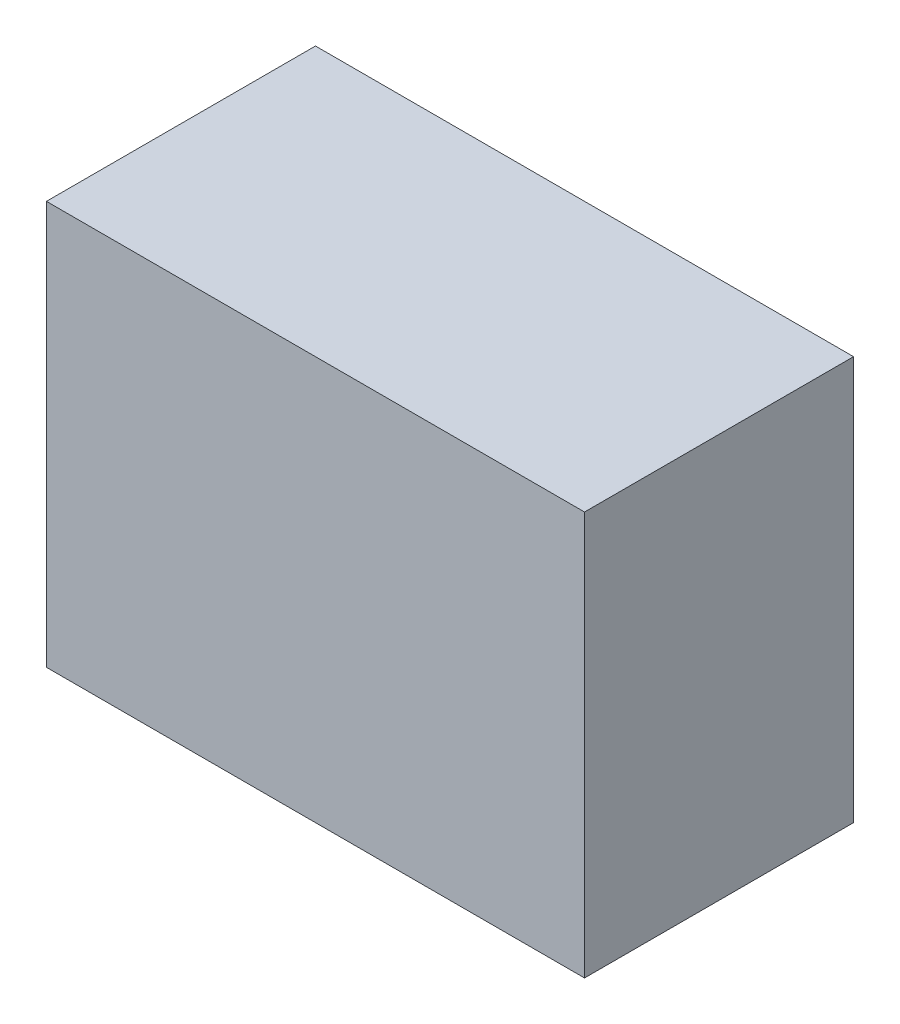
ISO-10303-21;
HEADER;
FILE_DESCRIPTION(('STEP AP214'),'2;1');
FILE_NAME('part.step','',(''),(''),'','','');
FILE_SCHEMA(('AUTOMOTIVE_DESIGN { 1 0 10303 214 1 1 1 1 }'));
ENDSEC;
DATA;
#1=APPLICATION_CONTEXT('core data for automotive mechanical design processes');
#2=APPLICATION_PROTOCOL_DEFINITION('international standard','automotive_design',2000,#1);
#3=PRODUCT_CONTEXT('',#1,'mechanical');
#4=PRODUCT('Part','Part','',(#3));
#5=PRODUCT_RELATED_PRODUCT_CATEGORY('part','',(#4));
#6=PRODUCT_DEFINITION_FORMATION('','',#4);
#7=PRODUCT_DEFINITION_CONTEXT('part definition',#1,'design');
#8=PRODUCT_DEFINITION('design','',#6,#7);
#9=PRODUCT_DEFINITION_SHAPE('','',#8);
#10=(LENGTH_UNIT() NAMED_UNIT(*) SI_UNIT(.MILLI.,.METRE.));
#11=(NAMED_UNIT(*) PLANE_ANGLE_UNIT() SI_UNIT($,.RADIAN.));
#12=(NAMED_UNIT(*) SI_UNIT($,.STERADIAN.) SOLID_ANGLE_UNIT());
#13=UNCERTAINTY_MEASURE_WITH_UNIT(LENGTH_MEASURE(1.E-05),#10,'distance_accuracy_value','');
#14=(GEOMETRIC_REPRESENTATION_CONTEXT(3) GLOBAL_UNCERTAINTY_ASSIGNED_CONTEXT((#13)) GLOBAL_UNIT_ASSIGNED_CONTEXT((#10,
#11,#12)) REPRESENTATION_CONTEXT('',''));
#15=CARTESIAN_POINT('',(0.,0.,0.));
#16=DIRECTION('',(0.,0.,1.));
#17=DIRECTION('',(1.,0.,0.));
#18=AXIS2_PLACEMENT_3D('',#15,#16,#17);
#19=CARTESIAN_POINT('',(1.00000000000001,1.5,0.5));
#20=DIRECTION('',(-1.,0.,0.));
#21=DIRECTION('',(0.,0.,1.));
#22=AXIS2_PLACEMENT_3D('',#19,#20,#21);
#23=PLANE('',#22);
#24=DIRECTION('',(0.,0.,-1.));
#25=VECTOR('',#24,1.);
#26=CARTESIAN_POINT('',(1.00000000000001,0.,0.5));
#27=LINE('',#26,#25);
#28=CARTESIAN_POINT('',(1.00000000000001,0.,0.5));
#29=VERTEX_POINT('',#28);
#30=CARTESIAN_POINT('',(1.00000000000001,0.,-0.5));
#31=VERTEX_POINT('',#30);
#32=EDGE_CURVE('E95',#29,#31,#27,.T.);
#33=ORIENTED_EDGE('',*,*,#32,.T.);
#34=DIRECTION('',(0.,-1.,0.));
#35=VECTOR('',#34,1.);
#36=CARTESIAN_POINT('',(1.00000000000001,1.5,-0.5));
#37=LINE('',#36,#35);
#38=CARTESIAN_POINT('',(1.00000000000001,1.5,-0.5));
#39=VERTEX_POINT('',#38);
#40=EDGE_CURVE('E11',#39,#31,#37,.T.);
#41=ORIENTED_EDGE('',*,*,#40,.F.);
#42=DIRECTION('',(0.,0.,-1.));
#43=VECTOR('',#42,1.);
#44=CARTESIAN_POINT('',(1.00000000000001,1.5,0.5));
#45=LINE('',#44,#43);
#46=CARTESIAN_POINT('',(1.00000000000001,1.5,0.5));
#47=VERTEX_POINT('',#46);
#48=EDGE_CURVE('E83',#47,#39,#45,.T.);
#49=ORIENTED_EDGE('',*,*,#48,.F.);
#50=DIRECTION('',(0.,-1.,0.));
#51=VECTOR('',#50,1.);
#52=CARTESIAN_POINT('',(1.00000000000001,1.5,0.5));
#53=LINE('',#52,#51);
#54=EDGE_CURVE('E91',#47,#29,#53,.T.);
#55=ORIENTED_EDGE('',*,*,#54,.T.);
#56=EDGE_LOOP('',(#33,#41,#49,#55));
#57=FACE_BOUND('',#56,.T.);
#58=ADVANCED_FACE('F32',(#57),#23,.F.);
#59=CARTESIAN_POINT('',(-0.999999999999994,1.5,-0.5));
#60=DIRECTION('',(0.,0.,1.));
#61=DIRECTION('',(1.,0.,0.));
#62=AXIS2_PLACEMENT_3D('',#59,#60,#61);
#63=PLANE('',#62);
#64=DIRECTION('',(-1.,0.,0.));
#65=VECTOR('',#64,1.);
#66=CARTESIAN_POINT('',(-0.999999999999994,0.,-0.5));
#67=LINE('',#66,#65);
#68=CARTESIAN_POINT('',(-0.999999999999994,0.,-0.5));
#69=VERTEX_POINT('',#68);
#70=EDGE_CURVE('E87',#31,#69,#67,.T.);
#71=ORIENTED_EDGE('',*,*,#70,.T.);
#72=DIRECTION('',(0.,-1.,0.));
#73=VECTOR('',#72,1.);
#74=CARTESIAN_POINT('',(-0.999999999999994,1.5,-0.5));
#75=LINE('',#74,#73);
#76=CARTESIAN_POINT('',(-0.999999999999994,1.5,-0.5));
#77=VERTEX_POINT('',#76);
#78=EDGE_CURVE('E40',#77,#69,#75,.T.);
#79=ORIENTED_EDGE('',*,*,#78,.F.);
#80=DIRECTION('',(-1.,0.,0.));
#81=VECTOR('',#80,1.);
#82=CARTESIAN_POINT('',(-0.999999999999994,1.5,-0.5));
#83=LINE('',#82,#81);
#84=EDGE_CURVE('E78',#39,#77,#83,.T.);
#85=ORIENTED_EDGE('',*,*,#84,.F.);
#86=ORIENTED_EDGE('',*,*,#40,.T.);
#87=EDGE_LOOP('',(#71,#79,#85,#86));
#88=FACE_BOUND('',#87,.T.);
#89=ADVANCED_FACE('F86',(#88),#63,.F.);
#90=CARTESIAN_POINT('',(-0.999999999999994,1.5,0.5));
#91=DIRECTION('',(1.,0.,0.));
#92=DIRECTION('',(0.,0.,-1.));
#93=AXIS2_PLACEMENT_3D('',#90,#91,#92);
#94=PLANE('',#93);
#95=DIRECTION('',(0.,0.,1.));
#96=VECTOR('',#95,1.);
#97=CARTESIAN_POINT('',(-0.999999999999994,0.,0.5));
#98=LINE('',#97,#96);
#99=CARTESIAN_POINT('',(-0.999999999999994,0.,0.5));
#100=VERTEX_POINT('',#99);
#101=EDGE_CURVE('E65',#69,#100,#98,.T.);
#102=ORIENTED_EDGE('',*,*,#101,.T.);
#103=DIRECTION('',(0.,-1.,0.));
#104=VECTOR('',#103,1.);
#105=CARTESIAN_POINT('',(-0.999999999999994,1.5,0.5));
#106=LINE('',#105,#104);
#107=CARTESIAN_POINT('',(-0.999999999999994,1.5,0.5));
#108=VERTEX_POINT('',#107);
#109=EDGE_CURVE('E88',#108,#100,#106,.T.);
#110=ORIENTED_EDGE('',*,*,#109,.F.);
#111=DIRECTION('',(0.,0.,1.));
#112=VECTOR('',#111,1.);
#113=CARTESIAN_POINT('',(-0.999999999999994,1.5,0.5));
#114=LINE('',#113,#112);
#115=EDGE_CURVE('E81',#77,#108,#114,.T.);
#116=ORIENTED_EDGE('',*,*,#115,.F.);
#117=ORIENTED_EDGE('',*,*,#78,.T.);
#118=EDGE_LOOP('',(#102,#110,#116,#117));
#119=FACE_BOUND('',#118,.T.);
#120=ADVANCED_FACE('F89',(#119),#94,.F.);
#121=CARTESIAN_POINT('',(-0.999999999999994,1.5,0.5));
#122=DIRECTION('',(0.,0.,-1.));
#123=DIRECTION('',(-1.,0.,0.));
#124=AXIS2_PLACEMENT_3D('',#121,#122,#123);
#125=PLANE('',#124);
#126=DIRECTION('',(1.,0.,0.));
#127=VECTOR('',#126,1.);
#128=CARTESIAN_POINT('',(-0.999999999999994,0.,0.5));
#129=LINE('',#128,#127);
#130=EDGE_CURVE('E71',#100,#29,#129,.T.);
#131=ORIENTED_EDGE('',*,*,#130,.T.);
#132=ORIENTED_EDGE('',*,*,#54,.F.);
#133=DIRECTION('',(1.,0.,0.));
#134=VECTOR('',#133,1.);
#135=CARTESIAN_POINT('',(-0.999999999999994,1.5,0.5));
#136=LINE('',#135,#134);
#137=EDGE_CURVE('E48',#108,#47,#136,.T.);
#138=ORIENTED_EDGE('',*,*,#137,.F.);
#139=ORIENTED_EDGE('',*,*,#109,.T.);
#140=EDGE_LOOP('',(#131,#132,#138,#139));
#141=FACE_BOUND('',#140,.T.);
#142=ADVANCED_FACE('F102',(#141),#125,.F.);
#143=CARTESIAN_POINT('',(0.,1.5,0.));
#144=DIRECTION('',(0.,-1.,0.));
#145=DIRECTION('',(0.,0.,-1.));
#146=AXIS2_PLACEMENT_3D('',#143,#144,#145);
#147=PLANE('',#146);
#148=ORIENTED_EDGE('',*,*,#48,.T.);
#149=ORIENTED_EDGE('',*,*,#84,.T.);
#150=ORIENTED_EDGE('',*,*,#115,.T.);
#151=ORIENTED_EDGE('',*,*,#137,.T.);
#152=EDGE_LOOP('',(#148,#149,#150,#151));
#153=FACE_BOUND('',#152,.T.);
#154=ADVANCED_FACE('F79',(#153),#147,.F.);
#155=CARTESIAN_POINT('',(0.,0.,0.));
#156=DIRECTION('',(0.,-1.,0.));
#157=DIRECTION('',(0.,0.,-1.));
#158=AXIS2_PLACEMENT_3D('',#155,#156,#157);
#159=PLANE('',#158);
#160=ORIENTED_EDGE('',*,*,#32,.F.);
#161=ORIENTED_EDGE('',*,*,#130,.F.);
#162=ORIENTED_EDGE('',*,*,#101,.F.);
#163=ORIENTED_EDGE('',*,*,#70,.F.);
#164=EDGE_LOOP('',(#160,#161,#162,#163));
#165=FACE_BOUND('',#164,.T.);
#166=ADVANCED_FACE('F105',(#165),#159,.T.);
#167=CLOSED_SHELL('',(#58,#89,#120,#142,#154,#166));
#168=MANIFOLD_SOLID_BREP('B2',#167);
#169=ADVANCED_BREP_SHAPE_REPRESENTATION('',(#18,#168),#14);
#170=SHAPE_DEFINITION_REPRESENTATION(#9,#169);
ENDSEC;
END-ISO-10303-21;
